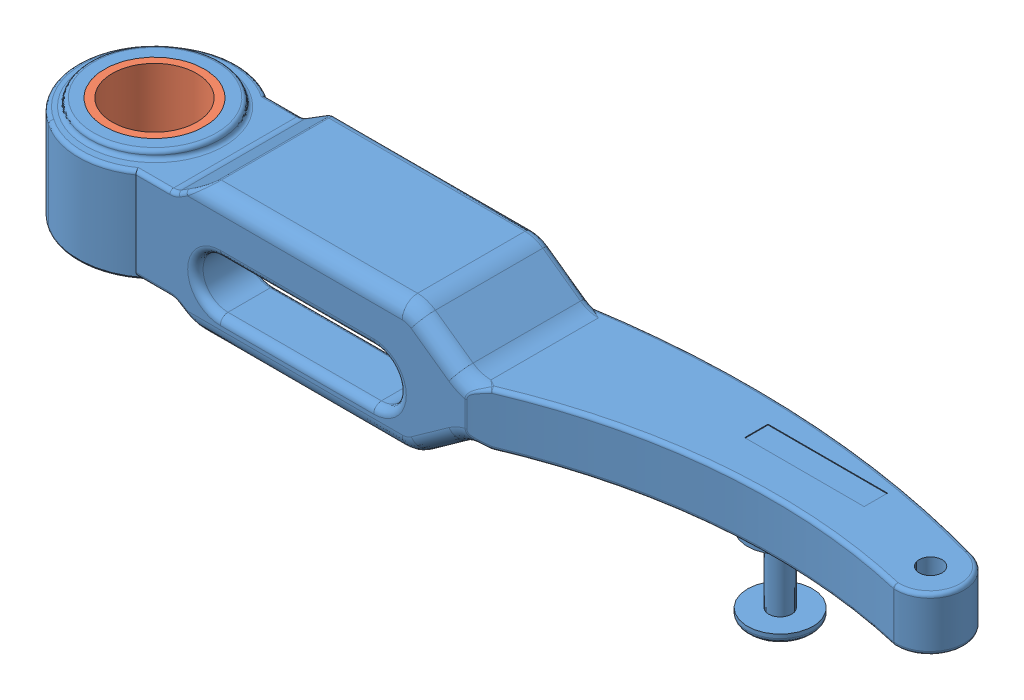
SolidWorks assembly levier-G.SLDASM, configuration Défaut (file format 9000). Lengths in mm.
Overall size (114.37 24.5 20.48).
2 component instances, 2 part files, 2 mates.
Components (placement in the parent):
- levier-G-1: levier-G.SLDPRT [Défaut] at (48.7473 1.7172 8.4566) size (114.37 24.5 20.48)
- bague levier-1: bague levier.SLDPRT [Défaut] at (-55.2527 -1.3828 0.0355) x (-1 0 0) z (0 1 0) size (13 13 13.6)
Mates (geometry in assembly coordinates):
- Coaxial1: concentric aligned: cylinder of levier-G-1 through (-55.2527 30.602 0.0355) axis (0 -1 0) radius 6.5; cylinder of bague levier-1 through (-55.2527 12.2172 0.0355) axis (0 -1 0) radius 6.5
- Coïncidente1: coincident aligned: plane of levier-G-1 through (-55.2524 12.2172 -0.0434) normal (0 1 0); plane of bague levier-1 through (-55.2527 12.2172 0.0355) normal (0 1 0)
